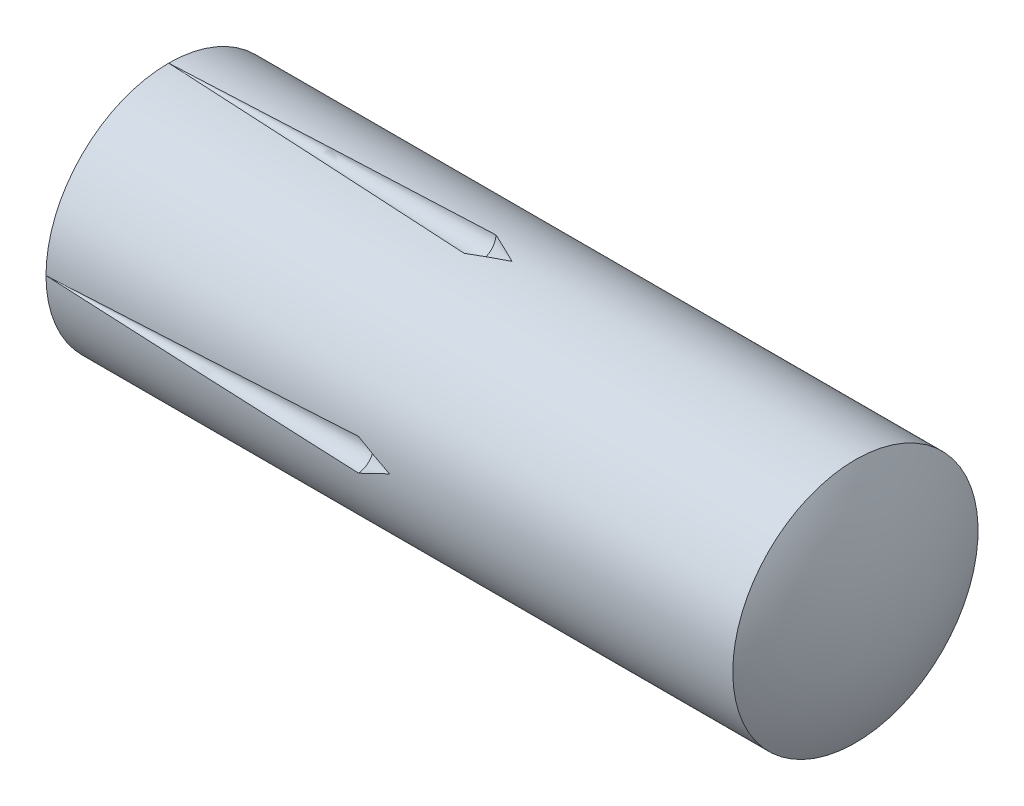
from build123d import *

# Parameters (mm, degrees)
R_P_TITION_CIRCULAIRE1_COUNT = 4
R_P_TITION_CIRCULAIRE1_ANGLE = 270


with BuildPart() as part:
    # Esquisse1 → Base-R_volution (revolve)
    with BuildSketch(Plane.XY, mode=Mode.PRIVATE) as base_r_volution_sk:
        with BuildLine():
            Line((1.3, 5), (29.3, 5))
            ThreePointArc((29.3, 5), (30.269685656, 2.583118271), (30.6, 0))
            Line((30.6, 0), (0, 0))
            ThreePointArc((0, 0), (0.330314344, 2.583118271), (1.3, 5))
        make_face()
    revolve(base_r_volution_sk.sketch.rotate(Axis((0, 0, 0), (1, 0, 0)), 90), axis=Axis((0, 0, 0), (1, 0, 0)))

    # Esquisse2 → Enlever de la mati_re-R_volution1 (revolve, cut)
    with BuildSketch(Plane(origin=(0, 5, 0), x_dir=(-1, 0, 0), z_dir=(0, 1, 0))):
        Polygon((-1.3, 0), (-15.3, 0), (-14, 0.65), align=None)
    enlever_de_la_mati_re_r_volution1 = revolve(axis=Axis((0, 5, 0), (1, 0, 0)), mode=Mode.SUBTRACT)

    # R_p_tition circulaire1: Enlever de la mati_re-R_volution1 ×4 about axis
    r_p_tition_circulaire1_axis = Axis((0, 0, 0), (-1, 0, 0))
    for i in range(1, R_P_TITION_CIRCULAIRE1_COUNT):
        add(enlever_de_la_mati_re_r_volution1.rotate(r_p_tition_circulaire1_axis, i * R_P_TITION_CIRCULAIRE1_ANGLE / (R_P_TITION_CIRCULAIRE1_COUNT - 1)), mode=Mode.SUBTRACT)


solid = part.part
